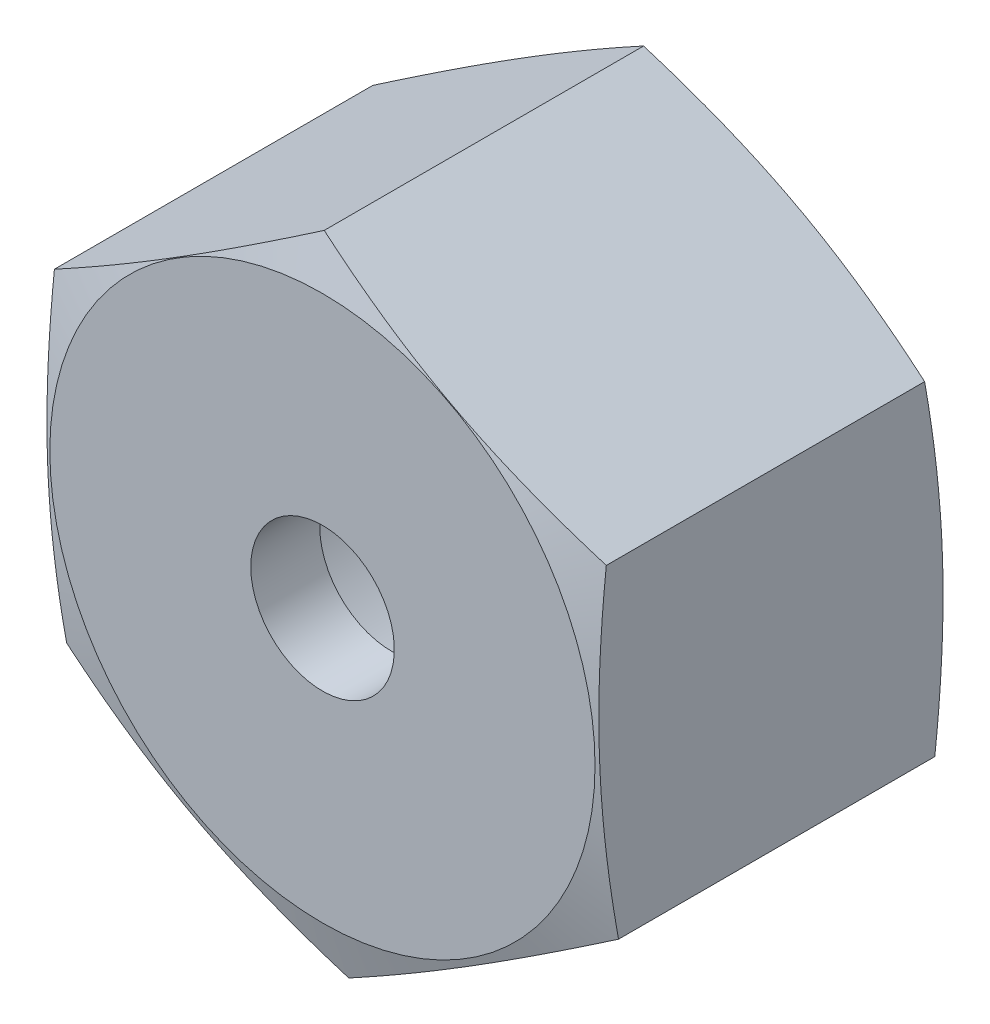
ISO-10303-21;
HEADER;
FILE_DESCRIPTION(('STEP AP214'),'2;1');
FILE_NAME('part.step','',(''),(''),'','','');
FILE_SCHEMA(('AUTOMOTIVE_DESIGN { 1 0 10303 214 1 1 1 1 }'));
ENDSEC;
DATA;
#1=APPLICATION_CONTEXT('core data for automotive mechanical design processes');
#2=APPLICATION_PROTOCOL_DEFINITION('international standard','automotive_design',2000,#1);
#3=PRODUCT_CONTEXT('',#1,'mechanical');
#4=PRODUCT('Part','Part','',(#3));
#5=PRODUCT_RELATED_PRODUCT_CATEGORY('part','',(#4));
#6=PRODUCT_DEFINITION_FORMATION('','',#4);
#7=PRODUCT_DEFINITION_CONTEXT('part definition',#1,'design');
#8=PRODUCT_DEFINITION('design','',#6,#7);
#9=PRODUCT_DEFINITION_SHAPE('','',#8);
#10=(LENGTH_UNIT() NAMED_UNIT(*) SI_UNIT(.MILLI.,.METRE.));
#11=(NAMED_UNIT(*) PLANE_ANGLE_UNIT() SI_UNIT($,.RADIAN.));
#12=(NAMED_UNIT(*) SI_UNIT($,.STERADIAN.) SOLID_ANGLE_UNIT());
#13=UNCERTAINTY_MEASURE_WITH_UNIT(LENGTH_MEASURE(1.E-05),#10,'distance_accuracy_value','');
#14=(GEOMETRIC_REPRESENTATION_CONTEXT(3) GLOBAL_UNCERTAINTY_ASSIGNED_CONTEXT((#13)) GLOBAL_UNIT_ASSIGNED_CONTEXT((#10,
#11,#12)) REPRESENTATION_CONTEXT('',''));
#15=CARTESIAN_POINT('',(0.,0.,0.));
#16=DIRECTION('',(0.,0.,1.));
#17=DIRECTION('',(1.,0.,0.));
#18=AXIS2_PLACEMENT_3D('',#15,#16,#17);
#19=CARTESIAN_POINT('',(-1.68718582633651,0.0798447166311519,5.55893792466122));
#20=DIRECTION('',(0.,0.,-1.));
#21=DIRECTION('',(-1.,0.,0.));
#22=AXIS2_PLACEMENT_3D('',#19,#20,#21);
#23=CONICAL_SURFACE('',#22,7.41910052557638,1.27805970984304);
#24=CARTESIAN_POINT('',(-1.68718582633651,0.0798447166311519,5.90550000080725));
#25=DIRECTION('',(0.,0.,-1.));
#26=DIRECTION('',(-1.,0.,0.));
#27=AXIS2_PLACEMENT_3D('',#24,#25,#26);
#28=CIRCLE('',#27,6.26924252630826);
#29=CARTESIAN_POINT('',(-7.95642835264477,0.0798447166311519,5.90550000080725));
#30=VERTEX_POINT('',#29);
#31=EDGE_CURVE('E20',#30,#30,#28,.F.);
#32=ORIENTED_EDGE('',*,*,#31,.F.);
#33=EDGE_LOOP('',(#32));
#34=FACE_BOUND('',#33,.T.);
#35=CARTESIAN_POINT('',(-8.15934342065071,3.44066024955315,5.59702555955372));
#36=CARTESIAN_POINT('',(-7.90145661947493,3.60189824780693,5.64362340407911));
#37=CARTESIAN_POINT('',(-7.64297539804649,3.7635078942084,5.68605721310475));
#38=CARTESIAN_POINT('',(-7.12483183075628,4.08746565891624,5.76085286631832));
#39=CARTESIAN_POINT('',(-6.86516891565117,4.24981413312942,5.79320918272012));
#40=CARTESIAN_POINT('',(-6.34668025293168,4.57398766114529,5.84587554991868));
#41=CARTESIAN_POINT('',(-6.08786040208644,4.73580902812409,5.86626419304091));
#42=CARTESIAN_POINT('',(-5.56977675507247,5.05972932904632,5.89401466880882));
#43=CARTESIAN_POINT('',(-5.31051309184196,5.22182817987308,5.90137988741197));
#44=CARTESIAN_POINT('',(-4.79194650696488,5.54605042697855,5.90256879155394));
#45=CARTESIAN_POINT('',(-4.53264358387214,5.70817382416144,5.8963916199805));
#46=CARTESIAN_POINT('',(-4.01444287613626,6.03216731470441,5.87093360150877));
#47=CARTESIAN_POINT('',(-3.75554521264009,6.19403733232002,5.8516493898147));
#48=CARTESIAN_POINT('',(-3.23687802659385,6.51832247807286,5.80105814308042));
#49=CARTESIAN_POINT('',(-2.97711423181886,6.68073402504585,5.76967165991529));
#50=CARTESIAN_POINT('',(-2.45875528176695,7.00482645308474,5.69665779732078));
#51=CARTESIAN_POINT('',(-2.20015957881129,7.16650767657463,5.65503586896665));
#52=CARTESIAN_POINT('',(-1.94216101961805,7.32781554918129,5.6091643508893));
#53=B_SPLINE_CURVE_WITH_KNOTS('',3,(#35,#36,#37,#38,#39,#40,#41,#42,#43,#44,#45,#46,#47,#48,#49,
#50,#51,#52),.UNSPECIFIED.,.F.,.F.,(4,2,2,2,2,2,2,2,4),(0.,0.923142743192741,1.84679096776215,
2.76430364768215,3.6815777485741,4.59890990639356,5.51647764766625,6.44017444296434,
7.3633803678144),.UNSPECIFIED.);
#54=CARTESIAN_POINT('',(-8.1593434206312,3.4406602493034,5.59702555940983));
#55=VERTEX_POINT('',#54);
#56=CARTESIAN_POINT('',(-1.9421610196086,7.3278155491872,5.60916435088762));
#57=VERTEX_POINT('',#56);
#58=EDGE_CURVE('E100',#55,#57,#53,.T.);
#59=ORIENTED_EDGE('',*,*,#58,.F.);
#60=CARTESIAN_POINT('',(-7.90155938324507,-3.88715529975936,5.57294690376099));
#61=CARTESIAN_POINT('',(-7.91225059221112,-3.5832450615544,5.61952871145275));
#62=CARTESIAN_POINT('',(-7.92296611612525,-3.27864364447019,5.66199341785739));
#63=CARTESIAN_POINT('',(-7.94444556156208,-2.66806505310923,5.73698118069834));
#64=CARTESIAN_POINT('',(-7.9552095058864,-2.36208723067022,5.7694989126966));
#65=CARTESIAN_POINT('',(-7.97670382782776,-1.75108575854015,5.82265795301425));
#66=CARTESIAN_POINT('',(-7.98743396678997,-1.44606889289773,5.84337530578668));
#67=CARTESIAN_POINT('',(-8.00891307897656,-0.835499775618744,5.87195913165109));
#68=CARTESIAN_POINT('',(-8.01966204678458,-0.529947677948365,5.87982883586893));
#69=CARTESIAN_POINT('',(-8.04116314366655,0.0812463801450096,5.88217989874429));
#70=CARTESIAN_POINT('',(-8.0519152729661,0.386888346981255,5.87665962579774));
#71=CARTESIAN_POINT('',(-8.07340384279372,0.997726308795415,5.85261282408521));
#72=CARTESIAN_POINT('',(-8.08414027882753,1.30292217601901,5.83408310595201));
#73=CARTESIAN_POINT('',(-8.10564908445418,1.91433536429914,5.7850395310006));
#74=CARTESIAN_POINT('',(-8.11642122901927,2.22054628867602,5.75444799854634));
#75=CARTESIAN_POINT('',(-8.13791821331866,2.83162344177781,5.68300436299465));
#76=CARTESIAN_POINT('',(-8.14864307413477,3.13649026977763,5.64215743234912));
#77=CARTESIAN_POINT('',(-8.15934342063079,3.44066024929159,5.59702555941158));
#78=B_SPLINE_CURVE_WITH_KNOTS('',3,(#60,#61,#62,#63,#64,#65,#66,#67,#68,#69,#70,#71,#72,#73,#74,
#75,#76,#77),.UNSPECIFIED.,.F.,.F.,(4,2,2,2,2,2,2,2,4),(0.,0.922998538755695,1.84649028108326,
2.76396146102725,3.68120186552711,4.59855404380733,5.51613119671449,6.43971648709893,
7.36283688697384),.UNSPECIFIED.);
#79=CARTESIAN_POINT('',(-7.90155938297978,-3.88715529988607,5.57294690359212));
#80=VERTEX_POINT('',#79);
#81=EDGE_CURVE('E104',#80,#55,#78,.T.);
#82=ORIENTED_EDGE('',*,*,#81,.F.);
#83=CARTESIAN_POINT('',(-1.42659294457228,-7.32781554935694,5.5610048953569));
#84=CARTESIAN_POINT('',(-1.69520558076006,-7.18508047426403,5.60685983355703));
#85=CARTESIAN_POINT('',(-1.96442350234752,-7.04202376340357,5.64856216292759));
#86=CARTESIAN_POINT('',(-2.50404801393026,-6.75527870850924,5.72200103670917));
#87=CARTESIAN_POINT('',(-2.77445513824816,-6.61159008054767,5.75373250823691));
#88=CARTESIAN_POINT('',(-3.3144305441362,-6.32465856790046,5.80535348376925));
#89=CARTESIAN_POINT('',(-3.5839931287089,-6.18141871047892,5.82531743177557));
#90=CARTESIAN_POINT('',(-4.12356356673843,-5.8947023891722,5.85248246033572));
#91=CARTESIAN_POINT('',(-4.39357129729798,-5.75122599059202,5.85968661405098));
#92=CARTESIAN_POINT('',(-4.9336253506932,-5.46425268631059,5.86084922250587));
#93=CARTESIAN_POINT('',(-5.20367167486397,-5.3207557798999,5.85480689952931));
#94=CARTESIAN_POINT('',(-5.74335793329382,-5.0339779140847,5.82988716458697));
#95=CARTESIAN_POINT('',(-6.01299775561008,-4.89069701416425,5.81100669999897));
#96=CARTESIAN_POINT('',(-6.55315123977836,-4.60367087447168,5.76142642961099));
#97=CARTESIAN_POINT('',(-6.82365937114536,-4.45992857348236,5.7306514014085));
#98=CARTESIAN_POINT('',(-7.36350028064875,-4.17306852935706,5.65897486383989));
#99=CARTESIAN_POINT('',(-7.63283357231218,-4.02995051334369,5.61807835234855));
#100=CARTESIAN_POINT('',(-7.90155938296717,-3.88715529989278,5.57294690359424));
#101=B_SPLINE_CURVE_WITH_KNOTS('',3,(#83,#84,#85,#86,#87,#88,#89,#90,#91,#92,#93,#94,#95,#96,
#97,#98,#99,#100),.UNSPECIFIED.,.F.,.F.,(4,2,2,2,2,2,2,2,4),(0.,0.922913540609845,
1.84629587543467,2.76377218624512,3.68102749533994,4.5983366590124,5.51586401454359,
6.43929143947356,7.3622637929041),.UNSPECIFIED.);
#102=CARTESIAN_POINT('',(-1.42659294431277,-7.32781554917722,5.56100489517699));
#103=VERTEX_POINT('',#102);
#104=EDGE_CURVE('E82',#103,#80,#101,.T.);
#105=ORIENTED_EDGE('',*,*,#104,.F.);
#106=CARTESIAN_POINT('',(4.79058945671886,-3.44066024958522,5.57294690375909));
#107=CARTESIAN_POINT('',(4.53256226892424,-3.60198602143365,5.61807835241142));
#108=CARTESIAN_POINT('',(4.27395178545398,-3.76367648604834,5.65897486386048));
#109=CARTESIAN_POINT('',(3.75560324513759,-4.0877624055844,5.73065140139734));
#110=CARTESIAN_POINT('',(3.49586469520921,-4.25015816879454,5.76142642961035));
#111=CARTESIAN_POINT('',(2.9772160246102,-4.57443173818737,5.81100670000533));
#112=CARTESIAN_POINT('',(2.71831121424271,-4.73630622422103,5.82988716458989));
#113=CARTESIAN_POINT('',(2.20011116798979,-5.06029930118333,5.85480689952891));
#114=CARTESIAN_POINT('',(1.94081603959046,-5.22241782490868,5.86084922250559));
#115=CARTESIAN_POINT('',(1.42226284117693,-5.54663170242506,5.85968661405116));
#116=CARTESIAN_POINT('',(1.16300476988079,-5.70872705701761,5.85248246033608));
#117=CARTESIAN_POINT('',(0.64491593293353,-6.03265060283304,5.82531743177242));
#118=CARTESIAN_POINT('',(0.386085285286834,-6.19447872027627,5.8053534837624));
#119=CARTESIAN_POINT('',(-0.132392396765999,-6.51864538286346,5.7537325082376));
#120=CARTESIAN_POINT('',(-0.392033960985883,-6.68098050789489,5.72200103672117));
#121=CARTESIAN_POINT('',(-0.910174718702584,-7.00493651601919,5.64856216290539));
#122=CARTESIAN_POINT('',(-1.16867442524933,-7.16655771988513,5.60685983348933));
#123=CARTESIAN_POINT('',(-1.42659294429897,-7.32781554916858,5.56100489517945));
#124=B_SPLINE_CURVE_WITH_KNOTS('',3,(#106,#107,#108,#109,#110,#111,#112,#113,#114,#115,#116,
#117,#118,#119,#120,#121,#122,#123),.UNSPECIFIED.,.F.,.F.,(4,2,2,2,2,2,2,2,4),(0.,
0.922972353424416,1.84639977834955,2.76392713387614,3.68123629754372,4.59849160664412,
5.51596791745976,6.43935025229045,7.3622637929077),.UNSPECIFIED.);
#125=CARTESIAN_POINT('',(4.79058945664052,-3.44066024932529,5.57294690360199));
#126=VERTEX_POINT('',#125);
#127=EDGE_CURVE('E79',#126,#103,#124,.T.);
#128=ORIENTED_EDGE('',*,*,#127,.F.);
#129=CARTESIAN_POINT('',(4.53280541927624,3.8871552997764,5.59702555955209));
#130=CARTESIAN_POINT('',(4.5435057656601,3.58298532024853,5.64215743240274));
#131=CARTESIAN_POINT('',(4.55423062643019,3.27811849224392,5.68300436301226));
#132=CARTESIAN_POINT('',(4.57572761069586,2.66704133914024,5.75444799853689));
#133=CARTESIAN_POINT('',(4.58649975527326,2.36083041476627,5.78503953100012));
#134=CARTESIAN_POINT('',(4.60800856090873,1.74941722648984,5.83408310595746));
#135=CARTESIAN_POINT('',(4.61874499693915,1.44422135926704,5.85261282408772));
#136=CARTESIAN_POINT('',(4.64023356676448,0.833383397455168,5.87665962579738));
#137=CARTESIAN_POINT('',(4.65098569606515,0.527741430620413,5.882179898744));
#138=CARTESIAN_POINT('',(4.67248679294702,-0.0834526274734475,5.87982883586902));
#139=CARTESIAN_POINT('',(4.68323576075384,-0.389004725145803,5.87195913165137));
#140=CARTESIAN_POINT('',(4.70471487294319,-0.999573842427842,5.8433753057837));
#141=CARTESIAN_POINT('',(4.71544501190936,-1.30459070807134,5.82265795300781));
#142=CARTESIAN_POINT('',(4.73693933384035,-1.91559218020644,5.76949891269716));
#143=CARTESIAN_POINT('',(4.74770327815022,-2.2215700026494,5.73698118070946));
#144=CARTESIAN_POINT('',(4.76918272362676,-2.83214859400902,5.66199341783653));
#145=CARTESIAN_POINT('',(4.77989824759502,-3.13675001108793,5.61952871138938));
#146=CARTESIAN_POINT('',(4.79058945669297,-3.44066024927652,5.57294690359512));
#147=B_SPLINE_CURVE_WITH_KNOTS('',3,(#129,#130,#131,#132,#133,#134,#135,#136,#137,#138,#139,
#140,#141,#142,#143,#144,#145,#146),.UNSPECIFIED.,.F.,.F.,(4,2,2,2,2,2,2,2,4),(0.,
0.923120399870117,1.84670569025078,2.76428284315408,3.68163502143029,4.59887542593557,
5.51634660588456,6.43983834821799,7.36283688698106),.UNSPECIFIED.);
#148=CARTESIAN_POINT('',(4.53280541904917,3.88715529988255,5.59702555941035));
#149=VERTEX_POINT('',#148);
#150=EDGE_CURVE('E67',#149,#126,#147,.T.);
#151=ORIENTED_EDGE('',*,*,#150,.F.);
#152=CARTESIAN_POINT('',(-1.94216101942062,7.32781554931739,5.60916435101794));
#153=CARTESIAN_POINT('',(-1.67346502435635,7.18503617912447,5.65503586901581));
#154=CARTESIAN_POINT('',(-1.40414712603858,7.04192634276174,5.69665779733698));
#155=CARTESIAN_POINT('',(-0.864295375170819,6.75506053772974,5.76967165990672));
#156=CARTESIAN_POINT('',(-0.593760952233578,6.61130426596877,5.80105814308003));
#157=CARTESIAN_POINT('',(-0.0535881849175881,6.32426787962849,5.85164938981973));
#158=CARTESIAN_POINT('',(0.216044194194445,6.18099093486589,5.8709336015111));
#159=CARTESIAN_POINT('',(0.755731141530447,5.8942127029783,5.89639161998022));
#160=CARTESIAN_POINT('',(1.0257855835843,5.75071148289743,5.90256879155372));
#161=CARTESIAN_POINT('',(1.56585357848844,5.46373077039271,5.90137988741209));
#162=CARTESIAN_POINT('',(1.83586713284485,5.32025127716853,5.89401466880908));
#163=CARTESIAN_POINT('',(2.37543216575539,5.033537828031,5.86626419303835));
#164=CARTESIAN_POINT('',(2.64498350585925,4.89030394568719,5.84587554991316));
#165=CARTESIAN_POINT('',(3.18497034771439,4.60336635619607,5.79320918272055));
#166=CARTESIAN_POINT('',(3.45539970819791,4.45966591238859,5.76085286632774));
#167=CARTESIAN_POINT('',(3.99502714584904,4.17291930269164,5.68605721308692));
#168=CARTESIAN_POINT('',(4.26422581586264,4.02987282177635,5.64362340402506));
#169=CARTESIAN_POINT('',(4.53280541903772,3.88715529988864,5.59702555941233));
#170=B_SPLINE_CURVE_WITH_KNOTS('',3,(#152,#153,#154,#155,#156,#157,#158,#159,#160,#161,#162,
#163,#164,#165,#166,#167,#168,#169),.UNSPECIFIED.,.F.,.F.,(4,2,2,2,2,2,2,2,4),(0.,
0.923205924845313,1.84690272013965,2.76447046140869,3.68180261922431,4.59907672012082,
5.51658940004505,6.44023762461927,7.36338036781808),.UNSPECIFIED.);
#171=EDGE_CURVE('E96',#57,#149,#170,.T.);
#172=ORIENTED_EDGE('',*,*,#171,.F.);
#173=EDGE_LOOP('',(#59,#82,#105,#128,#151,#172));
#174=FACE_BOUND('',#173,.T.);
#175=ADVANCED_FACE('F16',(#34,#174),#23,.T.);
#176=CARTESIAN_POINT('',(-1.68437698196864,0.,5.9055));
#177=DIRECTION('',(0.,0.,1.));
#178=DIRECTION('',(1.,0.,0.));
#179=AXIS2_PLACEMENT_3D('',#176,#177,#178);
#180=PLANE('',#179);
#181=CARTESIAN_POINT('',(-1.68437698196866,0.0799435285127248,5.9055));
#182=DIRECTION('',(0.,0.,-1.));
#183=DIRECTION('',(-1.,0.,0.));
#184=AXIS2_PLACEMENT_3D('',#181,#182,#183);
#185=CIRCLE('',#184,1.651);
#186=CARTESIAN_POINT('',(-3.33537698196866,0.0799435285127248,5.9055));
#187=VERTEX_POINT('',#186);
#188=EDGE_CURVE('E90',#187,#187,#185,.T.);
#189=ORIENTED_EDGE('',*,*,#188,.T.);
#190=EDGE_LOOP('',(#189));
#191=FACE_BOUND('',#190,.T.);
#192=ORIENTED_EDGE('',*,*,#31,.T.);
#193=EDGE_LOOP('',(#192));
#194=FACE_BOUND('',#193,.T.);
#195=ADVANCED_FACE('F292',(#191,#194),#180,.T.);
#196=CARTESIAN_POINT('',(4.79058945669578,-3.44066024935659,-2.032));
#197=DIRECTION('',(0.530137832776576,-0.847911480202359,0.));
#198=DIRECTION('',(0.847911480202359,0.530137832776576,0.));
#199=AXIS2_PLACEMENT_3D('',#196,#197,#198);
#200=PLANE('',#199);
#201=ORIENTED_EDGE('',*,*,#127,.T.);
#202=DIRECTION('',(0.,0.,1.));
#203=VECTOR('',#202,1.);
#204=CARTESIAN_POINT('',(-1.42659294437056,-7.32781554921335,-2.032));
#205=LINE('',#204,#203);
#206=CARTESIAN_POINT('',(-1.42659290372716,-7.32781552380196,-1.68750490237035));
#207=VERTEX_POINT('',#206);
#208=EDGE_CURVE('E86',#207,#103,#205,.T.);
#209=ORIENTED_EDGE('',*,*,#208,.F.);
#210=CARTESIAN_POINT('',(4.7905893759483,-3.44066030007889,-1.69944691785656));
#211=CARTESIAN_POINT('',(4.53256219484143,-3.60198606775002,-1.74457836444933));
#212=CARTESIAN_POINT('',(4.27395171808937,-3.76367652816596,-1.78547487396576));
#213=CARTESIAN_POINT('',(3.75560319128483,-4.08776243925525,-1.85715140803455));
#214=CARTESIAN_POINT('',(3.49586464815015,-4.25015819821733,-1.88792643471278));
#215=CARTESIAN_POINT('',(2.97721599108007,-4.57443175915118,-1.93750670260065));
#216=CARTESIAN_POINT('',(2.71831118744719,-4.7363062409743,-1.95638716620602));
#217=CARTESIAN_POINT('',(2.20011115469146,-5.06029930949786,-1.98130689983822));
#218=CARTESIAN_POINT('',(1.94081603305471,-5.22241782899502,-1.98734922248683));
#219=CARTESIAN_POINT('',(1.42226284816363,-5.54663169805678,-1.98618661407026));
#220=CARTESIAN_POINT('',(1.16300478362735,-5.70872704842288,-1.97898246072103));
#221=CARTESIAN_POINT('',(0.644915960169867,-6.03265058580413,-1.95181743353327));
#222=CARTESIAN_POINT('',(0.386085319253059,-6.19447869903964,-1.93185348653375));
#223=CARTESIAN_POINT('',(-0.132392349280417,-6.51864535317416,-1.88023251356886));
#224=CARTESIAN_POINT('',(-0.392033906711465,-6.68098047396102,-1.84850104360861));
#225=CARTESIAN_POINT('',(-0.910174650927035,-7.00493647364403,-1.7750621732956));
#226=CARTESIAN_POINT('',(-1.16867435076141,-7.16655767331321,-1.73335984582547));
#227=CARTESIAN_POINT('',(-1.42659286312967,-7.32781549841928,-1.68750490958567));
#228=B_SPLINE_CURVE_WITH_KNOTS('',3,(#210,#211,#212,#213,#214,#215,#216,#217,#218,#219,#220,
#221,#222,#223,#224,#225,#226,#227),.UNSPECIFIED.,.F.,.F.,(4,2,2,2,2,2,2,2,4),(0.,
0.922972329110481,1.84639972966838,2.7639270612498,3.68123620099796,4.59849148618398,
5.51596777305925,6.43935008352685,7.36226359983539),.UNSPECIFIED.);
#229=CARTESIAN_POINT('',(4.79058945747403,-3.44066027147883,-1.69944690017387));
#230=VERTEX_POINT('',#229);
#231=EDGE_CURVE('E89',#230,#207,#228,.T.);
#232=ORIENTED_EDGE('',*,*,#231,.F.);
#233=DIRECTION('',(0.,0.,1.));
#234=VECTOR('',#233,1.);
#235=CARTESIAN_POINT('',(4.79058945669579,-3.44066024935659,-2.032));
#236=LINE('',#235,#234);
#237=EDGE_CURVE('E72',#126,#230,#236,.F.);
#238=ORIENTED_EDGE('',*,*,#237,.F.);
#239=EDGE_LOOP('',(#201,#209,#232,#238));
#240=FACE_BOUND('',#239,.T.);
#241=ADVANCED_FACE('F88',(#240),#200,.T.);
#242=CARTESIAN_POINT('',(-1.42659294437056,-7.32781554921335,-2.032));
#243=DIRECTION('',(-0.469243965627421,-0.883068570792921,0.));
#244=DIRECTION('',(0.883068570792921,-0.469243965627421,0.));
#245=AXIS2_PLACEMENT_3D('',#242,#243,#244);
#246=PLANE('',#245);
#247=ORIENTED_EDGE('',*,*,#104,.T.);
#248=DIRECTION('',(0.,0.,1.));
#249=VECTOR('',#248,1.);
#250=CARTESIAN_POINT('',(-7.90155938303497,-3.88715529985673,-2.032));
#251=LINE('',#250,#249);
#252=CARTESIAN_POINT('',(-7.90155934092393,-3.88715532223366,-1.69944691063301));
#253=VERTEX_POINT('',#252);
#254=EDGE_CURVE('E105',#253,#80,#251,.T.);
#255=ORIENTED_EDGE('',*,*,#254,.F.);
#256=CARTESIAN_POINT('',(-1.42659288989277,-7.32781553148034,-1.68750485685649));
#257=CARTESIAN_POINT('',(-1.69520553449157,-7.18508048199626,-1.7333598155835));
#258=CARTESIAN_POINT('',(-1.96442345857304,-7.04202378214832,-1.77506215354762));
#259=CARTESIAN_POINT('',(-2.50404796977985,-6.7552787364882,-1.84850103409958));
#260=CARTESIAN_POINT('',(-2.77445509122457,-6.61159010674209,-1.88023250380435));
#261=CARTESIAN_POINT('',(-3.31443049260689,-6.32465859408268,-1.93185347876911));
#262=CARTESIAN_POINT('',(-3.5839930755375,-6.18141873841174,-1.95181742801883));
#263=CARTESIAN_POINT('',(-4.12356351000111,-5.89470241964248,-1.97898245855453));
#264=CARTESIAN_POINT('',(-4.39357123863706,-5.75122602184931,-1.98618661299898));
#265=CARTESIAN_POINT('',(-4.93362528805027,-5.4642527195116,-1.98734922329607));
#266=CARTESIAN_POINT('',(-5.2036716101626,-5.32075581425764,-1.98130690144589));
#267=CARTESIAN_POINT('',(-5.74335786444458,-5.03397795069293,-1.95638716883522));
#268=CARTESIAN_POINT('',(-6.0129976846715,-4.89069705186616,-1.93750670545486));
#269=CARTESIAN_POINT('',(-6.55315116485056,-4.60367091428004,-1.88792643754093));
#270=CARTESIAN_POINT('',(-6.82365929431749,-4.45992861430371,-1.85715141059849));
#271=CARTESIAN_POINT('',(-7.36350020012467,-4.1730685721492,-1.7854748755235));
#272=CARTESIAN_POINT('',(-7.63283348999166,-4.02995055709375,-1.74457836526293));
#273=CARTESIAN_POINT('',(-7.90155929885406,-3.88715534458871,-1.69944691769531));
#274=B_SPLINE_CURVE_WITH_KNOTS('',3,(#256,#257,#258,#259,#260,#261,#262,#263,#264,#265,#266,
#267,#268,#269,#270,#271,#272,#273),.UNSPECIFIED.,.F.,.F.,(4,2,2,2,2,2,2,2,4),(0.,
0.922913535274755,1.84629586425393,2.76377216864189,3.6810274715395,4.5983366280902,
5.5158639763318,6.43929139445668,7.36226374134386),.UNSPECIFIED.);
#275=EDGE_CURVE('E176',#207,#253,#274,.T.);
#276=ORIENTED_EDGE('',*,*,#275,.F.);
#277=ORIENTED_EDGE('',*,*,#208,.T.);
#278=EDGE_LOOP('',(#247,#255,#276,#277));
#279=FACE_BOUND('',#278,.T.);
#280=ADVANCED_FACE('F184',(#279),#246,.T.);
#281=CARTESIAN_POINT('',(-7.90155938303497,-3.88715529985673,-2.032));
#282=DIRECTION('',(-0.999381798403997,-0.035157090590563,0.));
#283=DIRECTION('',(0.035157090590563,-0.999381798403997,0.));
#284=AXIS2_PLACEMENT_3D('',#281,#282,#283);
#285=PLANE('',#284);
#286=ORIENTED_EDGE('',*,*,#81,.T.);
#287=DIRECTION('',(0.,0.,1.));
#288=VECTOR('',#287,1.);
#289=CARTESIAN_POINT('',(-8.15934342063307,3.44066024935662,-2.032));
#290=LINE('',#289,#288);
#291=CARTESIAN_POINT('',(-8.15934341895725,3.44066020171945,-1.72352556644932));
#292=VERTEX_POINT('',#291);
#293=EDGE_CURVE('E101',#292,#55,#290,.T.);
#294=ORIENTED_EDGE('',*,*,#293,.F.);
#295=CARTESIAN_POINT('',(-7.90155934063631,-3.88715533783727,-1.69944686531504));
#296=CARTESIAN_POINT('',(-7.91225057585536,-3.58324510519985,-1.74602869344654));
#297=CARTESIAN_POINT('',(-7.92296611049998,-3.2786436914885,-1.78849340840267));
#298=CARTESIAN_POINT('',(-7.94444556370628,-2.66806510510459,-1.86348117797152));
#299=CARTESIAN_POINT('',(-7.95520950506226,-2.36208728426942,-1.89599890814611));
#300=CARTESIAN_POINT('',(-7.97670382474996,-1.75108581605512,-1.94915794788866));
#301=CARTESIAN_POINT('',(-7.98743396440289,-1.44606895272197,-1.96987530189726));
#302=CARTESIAN_POINT('',(-8.00891307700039,-0.83549983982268,-1.99845912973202));
#303=CARTESIAN_POINT('',(-8.01966204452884,-0.529947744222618,-2.00632883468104));
#304=CARTESIAN_POINT('',(-8.04116314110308,0.0812463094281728,-2.00867989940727));
#305=CARTESIAN_POINT('',(-8.05191527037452,0.3868882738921,-2.00315962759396));
#306=CARTESIAN_POINT('',(-8.07340384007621,0.997726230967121,-1.9791128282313));
#307=CARTESIAN_POINT('',(-8.0841402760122,1.302922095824,-1.96058311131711));
#308=CARTESIAN_POINT('',(-8.10564908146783,1.91433527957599,-1.91153953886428));
#309=CARTESIAN_POINT('',(-8.11642122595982,2.22054620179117,-1.88094800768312));
#310=CARTESIAN_POINT('',(-8.1379182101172,2.83162335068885,-1.80950437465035));
#311=CARTESIAN_POINT('',(-8.14864307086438,3.1364901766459,-1.76865744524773));
#312=CARTESIAN_POINT('',(-8.15934341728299,3.44066015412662,-1.72352557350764));
#313=B_SPLINE_CURVE_WITH_KNOTS('',3,(#295,#296,#297,#298,#299,#300,#301,#302,#303,#304,#305,
#306,#307,#308,#309,#310,#311,#312),.UNSPECIFIED.,.F.,.F.,(4,2,2,2,2,2,2,2,4),(0.,
0.922998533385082,1.84649026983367,2.76396144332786,3.68120184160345,4.59855401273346,
5.51613115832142,6.43971644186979,7.36283683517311),.UNSPECIFIED.);
#314=EDGE_CURVE('E171',#253,#292,#313,.T.);
#315=ORIENTED_EDGE('',*,*,#314,.F.);
#316=ORIENTED_EDGE('',*,*,#254,.T.);
#317=EDGE_LOOP('',(#286,#294,#315,#316));
#318=FACE_BOUND('',#317,.T.);
#319=ADVANCED_FACE('F161',(#318),#285,.T.);
#320=CARTESIAN_POINT('',(-8.15934342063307,3.44066024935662,-2.032));
#321=DIRECTION('',(-0.530137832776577,0.847911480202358,0.));
#322=DIRECTION('',(-0.847911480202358,-0.530137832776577,0.));
#323=AXIS2_PLACEMENT_3D('',#320,#321,#322);
#324=PLANE('',#323);
#325=ORIENTED_EDGE('',*,*,#58,.T.);
#326=DIRECTION('',(0.,0.,1.));
#327=VECTOR('',#326,1.);
#328=CARTESIAN_POINT('',(-1.94216101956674,7.32781554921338,-2.032));
#329=LINE('',#328,#327);
#330=CARTESIAN_POINT('',(-1.94216106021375,7.32781552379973,-1.73566435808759));
#331=VERTEX_POINT('',#330);
#332=EDGE_CURVE('E97',#331,#57,#329,.T.);
#333=ORIENTED_EDGE('',*,*,#332,.F.);
#334=CARTESIAN_POINT('',(-8.15934343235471,3.44066019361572,-1.72352552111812));
#335=CARTESIAN_POINT('',(-7.90145664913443,3.60189821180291,-1.77012338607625));
#336=CARTESIAN_POINT('',(-7.64297543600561,3.76350786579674,-1.81255720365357));
#337=CARTESIAN_POINT('',(-7.12483187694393,4.08746563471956,-1.88735286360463));
#338=CARTESIAN_POINT('',(-6.86516896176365,4.24981410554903,-1.91970917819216));
#339=CARTESIAN_POINT('',(-6.34668030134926,4.57398762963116,-1.97237554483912));
#340=CARTESIAN_POINT('',(-6.08786045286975,4.73580899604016,-1.99276418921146));
#341=CARTESIAN_POINT('',(-5.56977680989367,5.05972929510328,-2.02051466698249));
#342=CARTESIAN_POINT('',(-5.31051314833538,5.22182814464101,-2.02787988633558));
#343=CARTESIAN_POINT('',(-4.79194656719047,5.54605038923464,-2.0290687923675));
#344=CARTESIAN_POINT('',(-4.53264364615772,5.70817378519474,-2.02289162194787));
#345=CARTESIAN_POINT('',(-4.0144429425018,6.03216727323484,-1.99743360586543));
#346=CARTESIAN_POINT('',(-3.75554528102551,6.19403728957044,-1.97814939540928));
#347=CARTESIAN_POINT('',(-3.2368780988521,6.51832243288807,-1.92755815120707));
#348=CARTESIAN_POINT('',(-2.97711430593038,6.6807339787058,-1.89617166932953));
#349=CARTESIAN_POINT('',(-2.45875535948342,7.00482640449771,-1.8231578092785));
#350=CARTESIAN_POINT('',(-2.20015965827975,7.16650762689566,-1.78153588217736));
#351=CARTESIAN_POINT('',(-1.94216110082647,7.32781549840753,-1.73566436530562));
#352=B_SPLINE_CURVE_WITH_KNOTS('',3,(#334,#335,#336,#337,#338,#339,#340,#341,#342,#343,#344,
#345,#346,#347,#348,#349,#350,#351),.UNSPECIFIED.,.F.,.F.,(4,2,2,2,2,2,2,2,4),(0.,
0.923142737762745,1.84679095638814,2.76430362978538,3.68157772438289,4.59890987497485,
5.51647760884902,6.44017439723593,7.36338031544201),.UNSPECIFIED.);
#353=EDGE_CURVE('E166',#292,#331,#352,.T.);
#354=ORIENTED_EDGE('',*,*,#353,.F.);
#355=ORIENTED_EDGE('',*,*,#293,.T.);
#356=EDGE_LOOP('',(#325,#333,#354,#355));
#357=FACE_BOUND('',#356,.T.);
#358=ADVANCED_FACE('F158',(#357),#324,.T.);
#359=CARTESIAN_POINT('',(-1.94216101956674,7.32781554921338,-2.032));
#360=DIRECTION('',(0.469243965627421,0.883068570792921,0.));
#361=DIRECTION('',(-0.883068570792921,0.469243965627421,0.));
#362=AXIS2_PLACEMENT_3D('',#359,#360,#361);
#363=PLANE('',#362);
#364=ORIENTED_EDGE('',*,*,#171,.T.);
#365=DIRECTION('',(0.,0.,1.));
#366=VECTOR('',#365,1.);
#367=CARTESIAN_POINT('',(4.5328054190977,3.88715529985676,-2.032));
#368=LINE('',#367,#366);
#369=CARTESIAN_POINT('',(4.5328053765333,3.88715532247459,-1.72352556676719));
#370=VERTEX_POINT('',#369);
#371=EDGE_CURVE('E73',#370,#149,#368,.T.);
#372=ORIENTED_EDGE('',*,*,#371,.F.);
#373=CARTESIAN_POINT('',(-1.94216107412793,7.32781553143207,-1.73566431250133));
#374=CARTESIAN_POINT('',(-1.6734650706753,7.18503618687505,-1.78153585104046));
#375=CARTESIAN_POINT('',(-1.40414716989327,7.04192636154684,-1.82315778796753));
#376=CARTESIAN_POINT('',(-0.864295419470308,6.75506056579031,-1.89617165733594));
#377=CARTESIAN_POINT('',(-0.593760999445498,6.61130429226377,-1.92755813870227));
#378=CARTESIAN_POINT('',(-0.0535882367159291,6.32426790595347,-1.97814938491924));
#379=CARTESIAN_POINT('',(0.216044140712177,6.18099096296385,-1.9974335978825));
#380=CARTESIAN_POINT('',(0.755731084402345,5.89421273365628,-2.02289161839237));
#381=CARTESIAN_POINT('',(1.02578552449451,5.75071151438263,-2.0290687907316));
#382=CARTESIAN_POINT('',(1.56585351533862,5.46373080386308,-2.02787988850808));
#383=CARTESIAN_POINT('',(1.83586706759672,5.32025131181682,-2.02051467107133));
#384=CARTESIAN_POINT('',(2.37543209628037,5.03353786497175,-1.99276419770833));
#385=CARTESIAN_POINT('',(2.64498343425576,4.89030398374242,-1.97237555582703));
#386=CARTESIAN_POINT('',(3.18497027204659,4.60336639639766,-1.91970919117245));
#387=CARTESIAN_POINT('',(3.45539963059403,4.45966595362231,-1.88735287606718));
#388=CARTESIAN_POINT('',(3.9950270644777,4.17291934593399,-1.81255722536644));
#389=CARTESIAN_POINT('',(4.26422573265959,4.02987286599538,-1.77012341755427));
#390=CARTESIAN_POINT('',(4.53280533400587,3.88715534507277,-1.72352557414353));
#391=B_SPLINE_CURVE_WITH_KNOTS('',3,(#373,#374,#375,#376,#377,#378,#379,#380,#381,#382,#383,
#384,#385,#386,#387,#388,#389,#390),.UNSPECIFIED.,.F.,.F.,(4,2,2,2,2,2,2,2,4),(0.,
0.923205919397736,1.84690270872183,2.76447044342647,3.68180259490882,4.59907668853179,
5.51658936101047,6.44023757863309,7.36338031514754),.UNSPECIFIED.);
#392=EDGE_CURVE('E35',#331,#370,#391,.T.);
#393=ORIENTED_EDGE('',*,*,#392,.F.);
#394=ORIENTED_EDGE('',*,*,#332,.T.);
#395=EDGE_LOOP('',(#364,#372,#393,#394));
#396=FACE_BOUND('',#395,.T.);
#397=ADVANCED_FACE('F136',(#396),#363,.T.);
#398=CARTESIAN_POINT('',(4.5328054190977,3.88715529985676,-2.032));
#399=DIRECTION('',(0.999381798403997,0.035157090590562,0.));
#400=DIRECTION('',(-0.035157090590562,0.999381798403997,0.));
#401=AXIS2_PLACEMENT_3D('',#398,#399,#400);
#402=PLANE('',#401);
#403=ORIENTED_EDGE('',*,*,#150,.T.);
#404=ORIENTED_EDGE('',*,*,#237,.T.);
#405=CARTESIAN_POINT('',(4.53280537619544,3.88715533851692,-1.72352552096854));
#406=CARTESIAN_POINT('',(4.5435057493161,3.5829853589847,-1.76865741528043));
#407=CARTESIAN_POINT('',(4.55423062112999,3.27811852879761,-1.809504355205));
#408=CARTESIAN_POINT('',(4.57572761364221,2.66704136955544,-1.88094799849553));
#409=CARTESIAN_POINT('',(4.58649975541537,2.36083044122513,-1.91153952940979));
#410=CARTESIAN_POINT('',(4.60800855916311,1.74941724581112,-1.9605831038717));
#411=CARTESIAN_POINT('',(4.61874499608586,1.44422137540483,-1.97911282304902));
#412=CARTESIAN_POINT('',(4.64023356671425,0.833383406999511,-2.0031596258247));
#413=CARTESIAN_POINT('',(4.65098569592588,0.52774143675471,-2.00867989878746));
#414=CARTESIAN_POINT('',(4.67248679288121,-0.0834526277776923,-2.00632883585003));
#415=CARTESIAN_POINT('',(4.68323576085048,-0.389004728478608,-1.99845913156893));
#416=CARTESIAN_POINT('',(4.70471487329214,-0.999573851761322,-1.96987530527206));
#417=CARTESIAN_POINT('',(4.71544501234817,-1.30459072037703,-1.94915795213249));
#418=CARTESIAN_POINT('',(4.73693933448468,-1.91559219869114,-1.89599891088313));
#419=CARTESIAN_POINT('',(4.7477032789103,-2.22157002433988,-1.86348117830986));
#420=CARTESIAN_POINT('',(4.76918272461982,-2.83214862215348,-1.7884934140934));
#421=CARTESIAN_POINT('',(4.77989824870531,-3.13675004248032,-1.74602870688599));
#422=CARTESIAN_POINT('',(4.79058945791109,-3.44066028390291,-1.69944689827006));
#423=B_SPLINE_CURVE_WITH_KNOTS('',3,(#405,#406,#407,#408,#409,#410,#411,#412,#413,#414,#415,
#416,#417,#418,#419,#420,#421,#422),.UNSPECIFIED.,.F.,.F.,(4,2,2,2,2,2,2,2,4),(0.,
0.923120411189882,1.84670571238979,2.76428287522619,3.68163506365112,4.59887547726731,
5.51634666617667,6.43983841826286,7.36283696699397),.UNSPECIFIED.);
#424=EDGE_CURVE('E117',#370,#230,#423,.T.);
#425=ORIENTED_EDGE('',*,*,#424,.F.);
#426=ORIENTED_EDGE('',*,*,#371,.T.);
#427=EDGE_LOOP('',(#403,#404,#425,#426));
#428=FACE_BOUND('',#427,.T.);
#429=ADVANCED_FACE('F69',(#428),#402,.T.);
#430=CARTESIAN_POINT('',(-1.68437698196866,0.0799435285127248,5.9055));
#431=DIRECTION('',(0.,0.,-1.));
#432=DIRECTION('',(-1.,0.,0.));
#433=AXIS2_PLACEMENT_3D('',#430,#431,#432);
#434=CYLINDRICAL_SURFACE('',#433,1.651);
#435=ORIENTED_EDGE('',*,*,#188,.F.);
#436=EDGE_LOOP('',(#435));
#437=FACE_BOUND('',#436,.T.);
#438=CARTESIAN_POINT('',(-1.68437698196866,0.0799435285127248,4.318));
#439=DIRECTION('',(0.,0.,-1.));
#440=DIRECTION('',(-1.,0.,0.));
#441=AXIS2_PLACEMENT_3D('',#438,#439,#440);
#442=CIRCLE('',#441,1.651);
#443=CARTESIAN_POINT('',(-3.33537698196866,0.0799435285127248,4.318));
#444=VERTEX_POINT('',#443);
#445=EDGE_CURVE('E114',#444,#444,#442,.T.);
#446=ORIENTED_EDGE('',*,*,#445,.T.);
#447=EDGE_LOOP('',(#446));
#448=FACE_BOUND('',#447,.T.);
#449=ADVANCED_FACE('F135',(#437,#448),#434,.F.);
#450=CARTESIAN_POINT('',(-1.68718582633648,0.0798447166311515,-1.68543792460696));
#451=DIRECTION('',(0.,0.,1.));
#452=DIRECTION('',(1.,0.,0.));
#453=AXIS2_PLACEMENT_3D('',#450,#451,#452);
#454=CONICAL_SURFACE('',#453,7.41910052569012,1.27805970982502);
#455=CARTESIAN_POINT('',(-1.68718582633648,0.0798447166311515,-2.03200000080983));
#456=DIRECTION('',(0.,0.,1.));
#457=DIRECTION('',(1.,0.,0.));
#458=AXIS2_PLACEMENT_3D('',#455,#456,#457);
#459=CIRCLE('',#458,6.26924252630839);
#460=CARTESIAN_POINT('',(4.58205669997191,0.0798447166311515,-2.03200000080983));
#461=VERTEX_POINT('',#460);
#462=EDGE_CURVE('E111',#461,#461,#459,.T.);
#463=ORIENTED_EDGE('',*,*,#462,.T.);
#464=EDGE_LOOP('',(#463));
#465=FACE_BOUND('',#464,.T.);
#466=ORIENTED_EDGE('',*,*,#392,.T.);
#467=ORIENTED_EDGE('',*,*,#424,.T.);
#468=ORIENTED_EDGE('',*,*,#231,.T.);
#469=ORIENTED_EDGE('',*,*,#275,.T.);
#470=ORIENTED_EDGE('',*,*,#314,.T.);
#471=ORIENTED_EDGE('',*,*,#353,.T.);
#472=EDGE_LOOP('',(#466,#467,#468,#469,#470,#471));
#473=FACE_BOUND('',#472,.T.);
#474=ADVANCED_FACE('F129',(#465,#473),#454,.T.);
#475=CARTESIAN_POINT('',(-1.68437698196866,0.0799435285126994,4.318));
#476=DIRECTION('',(0.,0.,1.));
#477=DIRECTION('',(1.,0.,0.));
#478=AXIS2_PLACEMENT_3D('',#475,#476,#477);
#479=PLANE('',#478);
#480=ORIENTED_EDGE('',*,*,#445,.F.);
#481=EDGE_LOOP('',(#480));
#482=FACE_BOUND('',#481,.T.);
#483=CARTESIAN_POINT('',(-1.68437698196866,0.0799435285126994,4.31800000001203));
#484=DIRECTION('',(0.,0.,-1.));
#485=DIRECTION('',(-1.,0.,0.));
#486=AXIS2_PLACEMENT_3D('',#483,#484,#485);
#487=CIRCLE('',#486,4.1679530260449);
#488=CARTESIAN_POINT('',(-5.85233000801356,0.0799435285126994,4.31800000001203));
#489=VERTEX_POINT('',#488);
#490=EDGE_CURVE('E26',#489,#489,#487,.T.);
#491=ORIENTED_EDGE('',*,*,#490,.T.);
#492=EDGE_LOOP('',(#491));
#493=FACE_BOUND('',#492,.T.);
#494=ADVANCED_FACE('F205',(#482,#493),#479,.F.);
#495=CARTESIAN_POINT('',(-1.68437698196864,0.,-2.032));
#496=DIRECTION('',(0.,0.,1.));
#497=DIRECTION('',(1.,0.,0.));
#498=AXIS2_PLACEMENT_3D('',#495,#496,#497);
#499=PLANE('',#498);
#500=CARTESIAN_POINT('',(-1.68437698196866,0.0799435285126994,-2.0319999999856));
#501=DIRECTION('',(0.,0.,-1.));
#502=DIRECTION('',(-1.,0.,0.));
#503=AXIS2_PLACEMENT_3D('',#500,#501,#502);
#504=CIRCLE('',#503,4.36562388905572);
#505=CARTESIAN_POINT('',(-6.05000087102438,0.0799435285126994,-2.0319999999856));
#506=VERTEX_POINT('',#505);
#507=EDGE_CURVE('E11',#506,#506,#504,.F.);
#508=ORIENTED_EDGE('',*,*,#507,.T.);
#509=EDGE_LOOP('',(#508));
#510=FACE_BOUND('',#509,.T.);
#511=ORIENTED_EDGE('',*,*,#462,.F.);
#512=EDGE_LOOP('',(#511));
#513=FACE_BOUND('',#512,.T.);
#514=ADVANCED_FACE('F212',(#510,#513),#499,.F.);
#515=CARTESIAN_POINT('',(-1.68437698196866,0.0799435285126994,-2.03199999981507));
#516=DIRECTION('',(0.,0.,-1.));
#517=DIRECTION('',(-1.,0.,0.));
#518=AXIS2_PLACEMENT_3D('',#515,#516,#517);
#519=CONICAL_SURFACE('',#518,4.36562388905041,0.0311192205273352);
#520=ORIENTED_EDGE('',*,*,#507,.F.);
#521=EDGE_LOOP('',(#520));
#522=FACE_BOUND('',#521,.T.);
#523=ORIENTED_EDGE('',*,*,#490,.F.);
#524=EDGE_LOOP('',(#523));
#525=FACE_BOUND('',#524,.T.);
#526=ADVANCED_FACE('F215',(#522,#525),#519,.F.);
#527=CLOSED_SHELL('',(#175,#195,#241,#280,#319,#358,#397,#429,#449,#474,#494,#514,#526));
#528=MANIFOLD_SOLID_BREP('B1',#527);
#529=ADVANCED_BREP_SHAPE_REPRESENTATION('',(#18,#528),#14);
#530=SHAPE_DEFINITION_REPRESENTATION(#9,#529);
ENDSEC;
END-ISO-10303-21;
